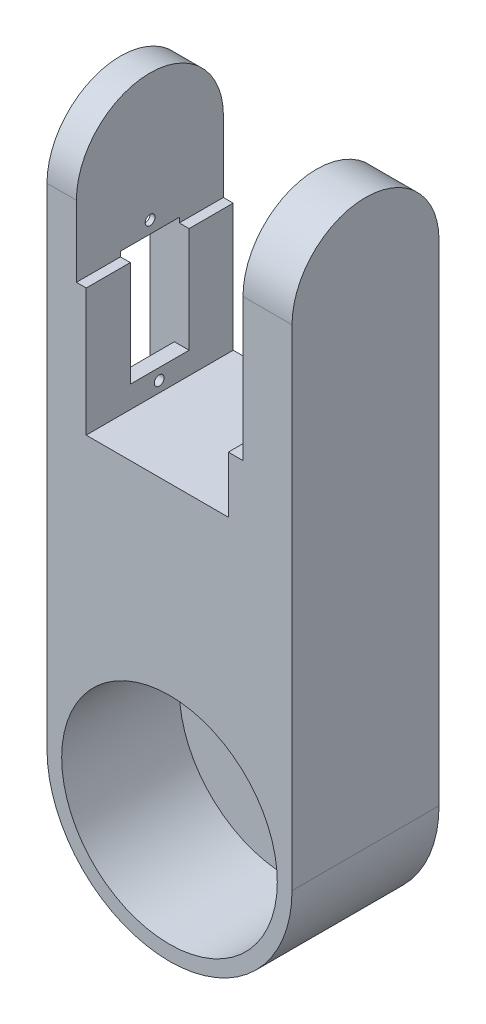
ISO-10303-21;
HEADER;
FILE_DESCRIPTION(('STEP AP214'),'2;1');
FILE_NAME('part.step','',(''),(''),'','','');
FILE_SCHEMA(('AUTOMOTIVE_DESIGN { 1 0 10303 214 1 1 1 1 }'));
ENDSEC;
DATA;
#1=APPLICATION_CONTEXT('core data for automotive mechanical design processes');
#2=APPLICATION_PROTOCOL_DEFINITION('international standard','automotive_design',2000,#1);
#3=PRODUCT_CONTEXT('',#1,'mechanical');
#4=PRODUCT('Part','Part','',(#3));
#5=PRODUCT_RELATED_PRODUCT_CATEGORY('part','',(#4));
#6=PRODUCT_DEFINITION_FORMATION('','',#4);
#7=PRODUCT_DEFINITION_CONTEXT('part definition',#1,'design');
#8=PRODUCT_DEFINITION('design','',#6,#7);
#9=PRODUCT_DEFINITION_SHAPE('','',#8);
#10=(LENGTH_UNIT() NAMED_UNIT(*) SI_UNIT(.MILLI.,.METRE.));
#11=(NAMED_UNIT(*) PLANE_ANGLE_UNIT() SI_UNIT($,.RADIAN.));
#12=(NAMED_UNIT(*) SI_UNIT($,.STERADIAN.) SOLID_ANGLE_UNIT());
#13=UNCERTAINTY_MEASURE_WITH_UNIT(LENGTH_MEASURE(1.E-05),#10,'distance_accuracy_value','');
#14=(GEOMETRIC_REPRESENTATION_CONTEXT(3) GLOBAL_UNCERTAINTY_ASSIGNED_CONTEXT((#13)) GLOBAL_UNIT_ASSIGNED_CONTEXT((#10,
#11,#12)) REPRESENTATION_CONTEXT('',''));
#15=CARTESIAN_POINT('',(0.,0.,0.));
#16=DIRECTION('',(0.,0.,1.));
#17=DIRECTION('',(1.,0.,0.));
#18=AXIS2_PLACEMENT_3D('',#15,#16,#17);
#19=CARTESIAN_POINT('',(15.,70.9790483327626,30.5447277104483));
#20=DIRECTION('',(0.,-1.,0.));
#21=DIRECTION('',(0.,0.,-1.));
#22=AXIS2_PLACEMENT_3D('',#19,#20,#21);
#23=PLANE('',#22);
#24=DIRECTION('',(1.,0.,0.));
#25=VECTOR('',#24,1.);
#26=CARTESIAN_POINT('',(0.,70.9790483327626,30.));
#27=LINE('',#26,#25);
#28=CARTESIAN_POINT('',(12.,70.9790483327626,30.));
#29=VERTEX_POINT('',#28);
#30=CARTESIAN_POINT('',(15.,70.9790483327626,30.));
#31=VERTEX_POINT('',#30);
#32=EDGE_CURVE('E351',#29,#31,#27,.T.);
#33=ORIENTED_EDGE('',*,*,#32,.T.);
#34=DIRECTION('',(0.,0.,-1.));
#35=VECTOR('',#34,1.);
#36=CARTESIAN_POINT('',(15.,70.9790483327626,30.5447277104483));
#37=LINE('',#36,#35);
#38=CARTESIAN_POINT('',(15.,70.9790483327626,0.));
#39=VERTEX_POINT('',#38);
#40=EDGE_CURVE('E10',#31,#39,#37,.T.);
#41=ORIENTED_EDGE('',*,*,#40,.T.);
#42=DIRECTION('',(-1.,0.,0.));
#43=VECTOR('',#42,1.);
#44=CARTESIAN_POINT('',(15.,70.9790483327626,0.));
#45=LINE('',#44,#43);
#46=CARTESIAN_POINT('',(12.,70.9790483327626,0.));
#47=VERTEX_POINT('',#46);
#48=EDGE_CURVE('E406',#39,#47,#45,.T.);
#49=ORIENTED_EDGE('',*,*,#48,.T.);
#50=DIRECTION('',(0.,0.,-1.));
#51=VECTOR('',#50,1.);
#52=CARTESIAN_POINT('',(12.,70.9790483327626,30.5447277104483));
#53=LINE('',#52,#51);
#54=EDGE_CURVE('E384',#29,#47,#53,.T.);
#55=ORIENTED_EDGE('',*,*,#54,.F.);
#56=EDGE_LOOP('',(#33,#41,#49,#55));
#57=FACE_BOUND('',#56,.T.);
#58=ADVANCED_FACE('F16',(#57),#23,.F.);
#59=CARTESIAN_POINT('',(15.,114.979048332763,30.5447277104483));
#60=DIRECTION('',(1.,0.,0.));
#61=DIRECTION('',(0.,1.,0.));
#62=AXIS2_PLACEMENT_3D('',#59,#60,#61);
#63=PLANE('',#62);
#64=DIRECTION('',(0.,1.,0.));
#65=VECTOR('',#64,1.);
#66=CARTESIAN_POINT('',(15.,-0.02095166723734,30.));
#67=LINE('',#66,#65);
#68=CARTESIAN_POINT('',(15.,99.9790483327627,30.));
#69=VERTEX_POINT('',#68);
#70=EDGE_CURVE('E347',#31,#69,#67,.T.);
#71=ORIENTED_EDGE('',*,*,#70,.T.);
#72=CARTESIAN_POINT('',(15.,99.9790483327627,15.));
#73=DIRECTION('',(-1.,0.,0.));
#74=DIRECTION('',(0.,0.,-1.));
#75=AXIS2_PLACEMENT_3D('',#72,#73,#74);
#76=CIRCLE('',#75,15.);
#77=CARTESIAN_POINT('',(15.,99.9790483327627,0.));
#78=VERTEX_POINT('',#77);
#79=EDGE_CURVE('E218',#69,#78,#76,.T.);
#80=ORIENTED_EDGE('',*,*,#79,.T.);
#81=DIRECTION('',(0.,-1.,0.));
#82=VECTOR('',#81,1.);
#83=CARTESIAN_POINT('',(15.,114.979048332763,0.));
#84=LINE('',#83,#82);
#85=EDGE_CURVE('E277',#78,#39,#84,.T.);
#86=ORIENTED_EDGE('',*,*,#85,.T.);
#87=ORIENTED_EDGE('',*,*,#40,.F.);
#88=EDGE_LOOP('',(#71,#80,#86,#87));
#89=FACE_BOUND('',#88,.T.);
#90=ADVANCED_FACE('F490',(#89),#63,.F.);
#91=CARTESIAN_POINT('',(-19.,87.4790483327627,30.5447277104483));
#92=DIRECTION('',(-1.,0.,0.));
#93=DIRECTION('',(0.,0.,1.));
#94=AXIS2_PLACEMENT_3D('',#91,#92,#93);
#95=PLANE('',#94);
#96=CARTESIAN_POINT('',(-19.,88.9790483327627,14.959336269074));
#97=DIRECTION('',(-1.,0.,0.));
#98=DIRECTION('',(0.,-1.,0.));
#99=AXIS2_PLACEMENT_3D('',#96,#97,#98);
#100=CIRCLE('',#99,1.);
#101=CARTESIAN_POINT('',(-19.,87.9790483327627,14.959336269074));
#102=VERTEX_POINT('',#101);
#103=EDGE_CURVE('E251',#102,#102,#100,.T.);
#104=ORIENTED_EDGE('',*,*,#103,.T.);
#105=EDGE_LOOP('',(#104));
#106=FACE_BOUND('',#105,.T.);
#107=DIRECTION('',(0.,-1.,0.));
#108=VECTOR('',#107,1.);
#109=CARTESIAN_POINT('',(-19.,-0.0209516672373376,30.));
#110=LINE('',#109,#108);
#111=CARTESIAN_POINT('',(-19.,99.9790483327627,30.));
#112=VERTEX_POINT('',#111);
#113=CARTESIAN_POINT('',(-19.,85.4790483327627,30.));
#114=VERTEX_POINT('',#113);
#115=EDGE_CURVE('E301',#112,#114,#110,.T.);
#116=ORIENTED_EDGE('',*,*,#115,.T.);
#117=DIRECTION('',(0.,0.,-1.));
#118=VECTOR('',#117,1.);
#119=CARTESIAN_POINT('',(-19.,85.4790483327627,30.5447277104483));
#120=LINE('',#119,#118);
#121=CARTESIAN_POINT('',(-19.,85.4790483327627,21.));
#122=VERTEX_POINT('',#121);
#123=EDGE_CURVE('E259',#114,#122,#120,.T.);
#124=ORIENTED_EDGE('',*,*,#123,.T.);
#125=DIRECTION('',(0.,1.,0.));
#126=VECTOR('',#125,1.);
#127=CARTESIAN_POINT('',(-19.,86.4790483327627,21.));
#128=LINE('',#127,#126);
#129=CARTESIAN_POINT('',(-19.,86.4790483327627,21.));
#130=VERTEX_POINT('',#129);
#131=EDGE_CURVE('E410',#122,#130,#128,.T.);
#132=ORIENTED_EDGE('',*,*,#131,.T.);
#133=DIRECTION('',(0.,0.,-1.));
#134=VECTOR('',#133,1.);
#135=CARTESIAN_POINT('',(-19.,86.4790483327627,9.));
#136=LINE('',#135,#134);
#137=CARTESIAN_POINT('',(-19.,86.4790483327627,9.));
#138=VERTEX_POINT('',#137);
#139=EDGE_CURVE('E227',#130,#138,#136,.T.);
#140=ORIENTED_EDGE('',*,*,#139,.T.);
#141=DIRECTION('',(0.,-1.,0.));
#142=VECTOR('',#141,1.);
#143=CARTESIAN_POINT('',(-19.,63.9790483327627,9.));
#144=LINE('',#143,#142);
#145=CARTESIAN_POINT('',(-19.,85.4790483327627,9.));
#146=VERTEX_POINT('',#145);
#147=EDGE_CURVE('E249',#138,#146,#144,.T.);
#148=ORIENTED_EDGE('',*,*,#147,.T.);
#149=DIRECTION('',(0.,0.,-1.));
#150=VECTOR('',#149,1.);
#151=CARTESIAN_POINT('',(-19.,85.4790483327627,30.5447277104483));
#152=LINE('',#151,#150);
#153=CARTESIAN_POINT('',(-19.,85.4790483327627,0.));
#154=VERTEX_POINT('',#153);
#155=EDGE_CURVE('E27',#146,#154,#152,.T.);
#156=ORIENTED_EDGE('',*,*,#155,.T.);
#157=DIRECTION('',(0.,1.,0.));
#158=VECTOR('',#157,1.);
#159=CARTESIAN_POINT('',(-19.,87.4790483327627,0.));
#160=LINE('',#159,#158);
#161=CARTESIAN_POINT('',(-19.,99.9790483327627,0.));
#162=VERTEX_POINT('',#161);
#163=EDGE_CURVE('E346',#154,#162,#160,.T.);
#164=ORIENTED_EDGE('',*,*,#163,.T.);
#165=CARTESIAN_POINT('',(-19.,99.9790483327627,15.));
#166=DIRECTION('',(1.,0.,0.));
#167=DIRECTION('',(0.,-1.,0.));
#168=AXIS2_PLACEMENT_3D('',#165,#166,#167);
#169=CIRCLE('',#168,15.);
#170=EDGE_CURVE('E402',#162,#112,#169,.T.);
#171=ORIENTED_EDGE('',*,*,#170,.T.);
#172=EDGE_LOOP('',(#116,#124,#132,#140,#148,#156,#164,#171));
#173=FACE_BOUND('',#172,.T.);
#174=ADVANCED_FACE('F496',(#106,#173),#95,.F.);
#175=CARTESIAN_POINT('',(-19.,85.4790483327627,30.5447277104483));
#176=DIRECTION('',(0.,-1.,0.));
#177=DIRECTION('',(0.,0.,-1.));
#178=AXIS2_PLACEMENT_3D('',#175,#176,#177);
#179=PLANE('',#178);
#180=DIRECTION('',(1.,0.,0.));
#181=VECTOR('',#180,1.);
#182=CARTESIAN_POINT('',(-15.5,85.4790483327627,9.));
#183=LINE('',#182,#181);
#184=CARTESIAN_POINT('',(-17.,85.4790483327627,9.));
#185=VERTEX_POINT('',#184);
#186=EDGE_CURVE('E245',#146,#185,#183,.T.);
#187=ORIENTED_EDGE('',*,*,#186,.T.);
#188=DIRECTION('',(0.,0.,-1.));
#189=VECTOR('',#188,1.);
#190=CARTESIAN_POINT('',(-17.,85.4790483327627,30.5447277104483));
#191=LINE('',#190,#189);
#192=CARTESIAN_POINT('',(-17.,85.4790483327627,0.));
#193=VERTEX_POINT('',#192);
#194=EDGE_CURVE('E380',#185,#193,#191,.T.);
#195=ORIENTED_EDGE('',*,*,#194,.T.);
#196=DIRECTION('',(-1.,0.,0.));
#197=VECTOR('',#196,1.);
#198=CARTESIAN_POINT('',(-19.,85.4790483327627,0.));
#199=LINE('',#198,#197);
#200=EDGE_CURVE('E341',#193,#154,#199,.T.);
#201=ORIENTED_EDGE('',*,*,#200,.T.);
#202=ORIENTED_EDGE('',*,*,#155,.F.);
#203=EDGE_LOOP('',(#187,#195,#201,#202));
#204=FACE_BOUND('',#203,.T.);
#205=ADVANCED_FACE('F513',(#204),#179,.F.);
#206=CARTESIAN_POINT('',(-17.,59.4790483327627,30.5447277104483));
#207=DIRECTION('',(0.,-1.,0.));
#208=DIRECTION('',(0.,0.,-1.));
#209=AXIS2_PLACEMENT_3D('',#206,#207,#208);
#210=PLANE('',#209);
#211=DIRECTION('',(1.,0.,0.));
#212=VECTOR('',#211,1.);
#213=CARTESIAN_POINT('',(0.,59.4790483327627,30.));
#214=LINE('',#213,#212);
#215=CARTESIAN_POINT('',(-17.,59.4790483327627,30.));
#216=VERTEX_POINT('',#215);
#217=CARTESIAN_POINT('',(12.,59.4790483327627,30.));
#218=VERTEX_POINT('',#217);
#219=EDGE_CURVE('E264',#216,#218,#214,.T.);
#220=ORIENTED_EDGE('',*,*,#219,.T.);
#221=DIRECTION('',(0.,0.,-1.));
#222=VECTOR('',#221,1.);
#223=CARTESIAN_POINT('',(12.,59.4790483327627,30.5447277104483));
#224=LINE('',#223,#222);
#225=CARTESIAN_POINT('',(12.,59.4790483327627,0.));
#226=VERTEX_POINT('',#225);
#227=EDGE_CURVE('E394',#218,#226,#224,.T.);
#228=ORIENTED_EDGE('',*,*,#227,.T.);
#229=DIRECTION('',(-1.,0.,0.));
#230=VECTOR('',#229,1.);
#231=CARTESIAN_POINT('',(-17.,59.4790483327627,0.));
#232=LINE('',#231,#230);
#233=CARTESIAN_POINT('',(-17.,59.4790483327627,0.));
#234=VERTEX_POINT('',#233);
#235=EDGE_CURVE('E569',#226,#234,#232,.T.);
#236=ORIENTED_EDGE('',*,*,#235,.T.);
#237=DIRECTION('',(0.,0.,-1.));
#238=VECTOR('',#237,1.);
#239=CARTESIAN_POINT('',(-17.,59.4790483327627,30.5447277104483));
#240=LINE('',#239,#238);
#241=EDGE_CURVE('E379',#216,#234,#240,.T.);
#242=ORIENTED_EDGE('',*,*,#241,.F.);
#243=EDGE_LOOP('',(#220,#228,#236,#242));
#244=FACE_BOUND('',#243,.T.);
#245=ADVANCED_FACE('F509',(#244),#210,.F.);
#246=CARTESIAN_POINT('',(12.,70.9790483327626,30.5447277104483));
#247=DIRECTION('',(1.,0.,0.));
#248=DIRECTION('',(0.,1.,0.));
#249=AXIS2_PLACEMENT_3D('',#246,#247,#248);
#250=PLANE('',#249);
#251=DIRECTION('',(0.,1.,0.));
#252=VECTOR('',#251,1.);
#253=CARTESIAN_POINT('',(12.,-0.0209516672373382,30.));
#254=LINE('',#253,#252);
#255=EDGE_CURVE('E269',#218,#29,#254,.T.);
#256=ORIENTED_EDGE('',*,*,#255,.T.);
#257=ORIENTED_EDGE('',*,*,#54,.T.);
#258=DIRECTION('',(0.,-1.,0.));
#259=VECTOR('',#258,1.);
#260=CARTESIAN_POINT('',(12.,70.9790483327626,0.));
#261=LINE('',#260,#259);
#262=EDGE_CURVE('E419',#47,#226,#261,.T.);
#263=ORIENTED_EDGE('',*,*,#262,.T.);
#264=ORIENTED_EDGE('',*,*,#227,.F.);
#265=EDGE_LOOP('',(#256,#257,#263,#264));
#266=FACE_BOUND('',#265,.T.);
#267=ADVANCED_FACE('F512',(#266),#250,.F.);
#268=CARTESIAN_POINT('',(-17.,85.4790483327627,30.5447277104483));
#269=DIRECTION('',(-1.,0.,0.));
#270=DIRECTION('',(0.,0.,1.));
#271=AXIS2_PLACEMENT_3D('',#268,#269,#270);
#272=PLANE('',#271);
#273=CARTESIAN_POINT('',(-17.,61.6790483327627,15.1));
#274=DIRECTION('',(1.,0.,0.));
#275=DIRECTION('',(0.,0.,1.));
#276=AXIS2_PLACEMENT_3D('',#273,#274,#275);
#277=CIRCLE('',#276,1.);
#278=CARTESIAN_POINT('',(-17.,61.6790483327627,16.1));
#279=VERTEX_POINT('',#278);
#280=EDGE_CURVE('E39',#279,#279,#277,.T.);
#281=ORIENTED_EDGE('',*,*,#280,.F.);
#282=EDGE_LOOP('',(#281));
#283=FACE_BOUND('',#282,.T.);
#284=DIRECTION('',(0.,-1.,0.));
#285=VECTOR('',#284,1.);
#286=CARTESIAN_POINT('',(-17.,-0.02095166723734,30.));
#287=LINE('',#286,#285);
#288=CARTESIAN_POINT('',(-17.,85.4790483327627,30.));
#289=VERTEX_POINT('',#288);
#290=EDGE_CURVE('E268',#289,#216,#287,.T.);
#291=ORIENTED_EDGE('',*,*,#290,.T.);
#292=ORIENTED_EDGE('',*,*,#241,.T.);
#293=DIRECTION('',(0.,1.,0.));
#294=VECTOR('',#293,1.);
#295=CARTESIAN_POINT('',(-17.,85.4790483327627,0.));
#296=LINE('',#295,#294);
#297=EDGE_CURVE('E345',#234,#193,#296,.T.);
#298=ORIENTED_EDGE('',*,*,#297,.T.);
#299=ORIENTED_EDGE('',*,*,#194,.F.);
#300=DIRECTION('',(0.,-1.,0.));
#301=VECTOR('',#300,1.);
#302=CARTESIAN_POINT('',(-17.,63.9790483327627,9.));
#303=LINE('',#302,#301);
#304=CARTESIAN_POINT('',(-17.,63.9790483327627,9.));
#305=VERTEX_POINT('',#304);
#306=EDGE_CURVE('E250',#185,#305,#303,.T.);
#307=ORIENTED_EDGE('',*,*,#306,.T.);
#308=DIRECTION('',(0.,0.,1.));
#309=VECTOR('',#308,1.);
#310=CARTESIAN_POINT('',(-17.,63.9790483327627,21.));
#311=LINE('',#310,#309);
#312=CARTESIAN_POINT('',(-17.,63.9790483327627,21.));
#313=VERTEX_POINT('',#312);
#314=EDGE_CURVE('E320',#305,#313,#311,.T.);
#315=ORIENTED_EDGE('',*,*,#314,.T.);
#316=DIRECTION('',(0.,1.,0.));
#317=VECTOR('',#316,1.);
#318=CARTESIAN_POINT('',(-17.,86.4790483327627,21.));
#319=LINE('',#318,#317);
#320=CARTESIAN_POINT('',(-17.,85.4790483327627,21.));
#321=VERTEX_POINT('',#320);
#322=EDGE_CURVE('E306',#313,#321,#319,.T.);
#323=ORIENTED_EDGE('',*,*,#322,.T.);
#324=DIRECTION('',(0.,0.,-1.));
#325=VECTOR('',#324,1.);
#326=CARTESIAN_POINT('',(-17.,85.4790483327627,30.5447277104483));
#327=LINE('',#326,#325);
#328=EDGE_CURVE('E255',#289,#321,#327,.T.);
#329=ORIENTED_EDGE('',*,*,#328,.F.);
#330=EDGE_LOOP('',(#291,#292,#298,#299,#307,#315,#323,#329));
#331=FACE_BOUND('',#330,.T.);
#332=ADVANCED_FACE('F647',(#283,#331),#272,.F.);
#333=CARTESIAN_POINT('',(-19.,85.4790483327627,30.5447277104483));
#334=DIRECTION('',(0.,-1.,0.));
#335=DIRECTION('',(0.,0.,-1.));
#336=AXIS2_PLACEMENT_3D('',#333,#334,#335);
#337=PLANE('',#336);
#338=DIRECTION('',(1.,0.,0.));
#339=VECTOR('',#338,1.);
#340=CARTESIAN_POINT('',(0.,85.4790483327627,30.));
#341=LINE('',#340,#339);
#342=EDGE_CURVE('E311',#114,#289,#341,.T.);
#343=ORIENTED_EDGE('',*,*,#342,.T.);
#344=ORIENTED_EDGE('',*,*,#328,.T.);
#345=DIRECTION('',(-1.,0.,0.));
#346=VECTOR('',#345,1.);
#347=CARTESIAN_POINT('',(-15.5,85.4790483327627,21.));
#348=LINE('',#347,#346);
#349=EDGE_CURVE('E440',#321,#122,#348,.T.);
#350=ORIENTED_EDGE('',*,*,#349,.T.);
#351=ORIENTED_EDGE('',*,*,#123,.F.);
#352=EDGE_LOOP('',(#343,#344,#350,#351));
#353=FACE_BOUND('',#352,.T.);
#354=ADVANCED_FACE('F651',(#353),#337,.F.);
#355=CARTESIAN_POINT('',(-17.,61.6790483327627,15.1));
#356=DIRECTION('',(-1.,0.,0.));
#357=DIRECTION('',(0.,0.,1.));
#358=AXIS2_PLACEMENT_3D('',#355,#356,#357);
#359=CYLINDRICAL_SURFACE('',#358,1.);
#360=CARTESIAN_POINT('',(-20.,61.6790483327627,15.1));
#361=DIRECTION('',(1.,0.,0.));
#362=DIRECTION('',(0.,0.,-1.));
#363=AXIS2_PLACEMENT_3D('',#360,#361,#362);
#364=CIRCLE('',#363,1.);
#365=CARTESIAN_POINT('',(-20.,61.6790483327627,14.1));
#366=VERTEX_POINT('',#365);
#367=EDGE_CURVE('E254',#366,#366,#364,.T.);
#368=ORIENTED_EDGE('',*,*,#367,.F.);
#369=EDGE_LOOP('',(#368));
#370=FACE_BOUND('',#369,.T.);
#371=ORIENTED_EDGE('',*,*,#280,.T.);
#372=EDGE_LOOP('',(#371));
#373=FACE_BOUND('',#372,.T.);
#374=ADVANCED_FACE('F501',(#370,#373),#359,.F.);
#375=CARTESIAN_POINT('',(-17.,88.9790483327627,14.959336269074));
#376=DIRECTION('',(-1.,0.,0.));
#377=DIRECTION('',(0.,0.,1.));
#378=AXIS2_PLACEMENT_3D('',#375,#376,#377);
#379=CYLINDRICAL_SURFACE('',#378,1.);
#380=CARTESIAN_POINT('',(-20.,88.9790483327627,14.959336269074));
#381=DIRECTION('',(1.,0.,0.));
#382=DIRECTION('',(0.,0.,1.));
#383=AXIS2_PLACEMENT_3D('',#380,#381,#382);
#384=CIRCLE('',#383,1.);
#385=CARTESIAN_POINT('',(-20.,88.9790483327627,15.959336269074));
#386=VERTEX_POINT('',#385);
#387=EDGE_CURVE('E240',#386,#386,#384,.T.);
#388=ORIENTED_EDGE('',*,*,#387,.F.);
#389=EDGE_LOOP('',(#388));
#390=FACE_BOUND('',#389,.T.);
#391=ORIENTED_EDGE('',*,*,#103,.F.);
#392=EDGE_LOOP('',(#391));
#393=FACE_BOUND('',#392,.T.);
#394=ADVANCED_FACE('F665',(#390,#393),#379,.F.);
#395=CARTESIAN_POINT('',(-20.,0.,0.));
#396=DIRECTION('',(1.,0.,0.));
#397=DIRECTION('',(0.,1.,0.));
#398=AXIS2_PLACEMENT_3D('',#395,#396,#397);
#399=PLANE('',#398);
#400=DIRECTION('',(0.,0.,-1.));
#401=VECTOR('',#400,1.);
#402=CARTESIAN_POINT('',(-20.,58.4790483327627,21.));
#403=LINE('',#402,#401);
#404=CARTESIAN_POINT('',(-20.,58.4790483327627,21.));
#405=VERTEX_POINT('',#404);
#406=CARTESIAN_POINT('',(-20.,58.4790483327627,9.));
#407=VERTEX_POINT('',#406);
#408=EDGE_CURVE('E243',#405,#407,#403,.T.);
#409=ORIENTED_EDGE('',*,*,#408,.F.);
#410=DIRECTION('',(0.,-1.,0.));
#411=VECTOR('',#410,1.);
#412=CARTESIAN_POINT('',(-20.,59.4790483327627,21.));
#413=LINE('',#412,#411);
#414=CARTESIAN_POINT('',(-20.,63.9790483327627,21.));
#415=VERTEX_POINT('',#414);
#416=EDGE_CURVE('E364',#415,#405,#413,.T.);
#417=ORIENTED_EDGE('',*,*,#416,.F.);
#418=DIRECTION('',(0.,0.,1.));
#419=VECTOR('',#418,1.);
#420=CARTESIAN_POINT('',(-20.,63.9790483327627,21.));
#421=LINE('',#420,#419);
#422=CARTESIAN_POINT('',(-20.,63.9790483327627,9.));
#423=VERTEX_POINT('',#422);
#424=EDGE_CURVE('E278',#423,#415,#421,.T.);
#425=ORIENTED_EDGE('',*,*,#424,.F.);
#426=DIRECTION('',(0.,1.,0.));
#427=VECTOR('',#426,1.);
#428=CARTESIAN_POINT('',(-20.,59.4790483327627,9.));
#429=LINE('',#428,#427);
#430=EDGE_CURVE('E262',#407,#423,#429,.T.);
#431=ORIENTED_EDGE('',*,*,#430,.F.);
#432=EDGE_LOOP('',(#409,#417,#425,#431));
#433=FACE_BOUND('',#432,.T.);
#434=ORIENTED_EDGE('',*,*,#367,.T.);
#435=EDGE_LOOP('',(#434));
#436=FACE_BOUND('',#435,.T.);
#437=ADVANCED_FACE('F662',(#433,#436),#399,.F.);
#438=CARTESIAN_POINT('',(-20.,58.4790483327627,21.));
#439=DIRECTION('',(0.,1.,0.));
#440=DIRECTION('',(1.,0.,0.));
#441=AXIS2_PLACEMENT_3D('',#438,#439,#440);
#442=PLANE('',#441);
#443=DIRECTION('',(0.,0.,-1.));
#444=VECTOR('',#443,1.);
#445=CARTESIAN_POINT('',(-25.,58.4790483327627,21.));
#446=LINE('',#445,#444);
#447=CARTESIAN_POINT('',(-25.,58.4790483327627,21.));
#448=VERTEX_POINT('',#447);
#449=CARTESIAN_POINT('',(-25.,58.4790483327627,9.));
#450=VERTEX_POINT('',#449);
#451=EDGE_CURVE('E238',#448,#450,#446,.T.);
#452=ORIENTED_EDGE('',*,*,#451,.F.);
#453=DIRECTION('',(-1.,0.,0.));
#454=VECTOR('',#453,1.);
#455=CARTESIAN_POINT('',(-20.,58.4790483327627,21.));
#456=LINE('',#455,#454);
#457=EDGE_CURVE('E337',#405,#448,#456,.T.);
#458=ORIENTED_EDGE('',*,*,#457,.F.);
#459=ORIENTED_EDGE('',*,*,#408,.T.);
#460=DIRECTION('',(-1.,0.,0.));
#461=VECTOR('',#460,1.);
#462=CARTESIAN_POINT('',(-20.,58.4790483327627,9.));
#463=LINE('',#462,#461);
#464=EDGE_CURVE('E295',#407,#450,#463,.T.);
#465=ORIENTED_EDGE('',*,*,#464,.T.);
#466=EDGE_LOOP('',(#452,#458,#459,#465));
#467=FACE_BOUND('',#466,.T.);
#468=ADVANCED_FACE('F589',(#467),#442,.T.);
#469=CARTESIAN_POINT('',(-20.,0.,0.));
#470=DIRECTION('',(-1.,0.,0.));
#471=DIRECTION('',(0.,0.,1.));
#472=AXIS2_PLACEMENT_3D('',#469,#470,#471);
#473=PLANE('',#472);
#474=DIRECTION('',(0.,-1.,0.));
#475=VECTOR('',#474,1.);
#476=CARTESIAN_POINT('',(-20.,90.9790483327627,9.));
#477=LINE('',#476,#475);
#478=CARTESIAN_POINT('',(-20.,91.9790483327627,9.));
#479=VERTEX_POINT('',#478);
#480=CARTESIAN_POINT('',(-20.,86.4790483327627,9.));
#481=VERTEX_POINT('',#480);
#482=EDGE_CURVE('E312',#479,#481,#477,.T.);
#483=ORIENTED_EDGE('',*,*,#482,.T.);
#484=DIRECTION('',(0.,0.,1.));
#485=VECTOR('',#484,1.);
#486=CARTESIAN_POINT('',(-20.,86.4790483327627,21.));
#487=LINE('',#486,#485);
#488=CARTESIAN_POINT('',(-20.,86.4790483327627,21.));
#489=VERTEX_POINT('',#488);
#490=EDGE_CURVE('E307',#481,#489,#487,.T.);
#491=ORIENTED_EDGE('',*,*,#490,.T.);
#492=DIRECTION('',(0.,1.,0.));
#493=VECTOR('',#492,1.);
#494=CARTESIAN_POINT('',(-20.,90.9790483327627,21.));
#495=LINE('',#494,#493);
#496=CARTESIAN_POINT('',(-20.,91.9790483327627,21.));
#497=VERTEX_POINT('',#496);
#498=EDGE_CURVE('E336',#489,#497,#495,.T.);
#499=ORIENTED_EDGE('',*,*,#498,.T.);
#500=DIRECTION('',(0.,0.,-1.));
#501=VECTOR('',#500,1.);
#502=CARTESIAN_POINT('',(-20.,91.9790483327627,21.));
#503=LINE('',#502,#501);
#504=EDGE_CURVE('E244',#497,#479,#503,.T.);
#505=ORIENTED_EDGE('',*,*,#504,.T.);
#506=EDGE_LOOP('',(#483,#491,#499,#505));
#507=FACE_BOUND('',#506,.T.);
#508=ORIENTED_EDGE('',*,*,#387,.T.);
#509=EDGE_LOOP('',(#508));
#510=FACE_BOUND('',#509,.T.);
#511=ADVANCED_FACE('F525',(#507,#510),#473,.T.);
#512=CARTESIAN_POINT('',(-20.,91.9790483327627,21.));
#513=DIRECTION('',(0.,1.,0.));
#514=DIRECTION('',(1.,0.,0.));
#515=AXIS2_PLACEMENT_3D('',#512,#513,#514);
#516=PLANE('',#515);
#517=DIRECTION('',(0.,0.,-1.));
#518=VECTOR('',#517,1.);
#519=CARTESIAN_POINT('',(-25.,91.9790483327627,21.));
#520=LINE('',#519,#518);
#521=CARTESIAN_POINT('',(-25.,91.9790483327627,21.));
#522=VERTEX_POINT('',#521);
#523=CARTESIAN_POINT('',(-25.,91.9790483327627,9.));
#524=VERTEX_POINT('',#523);
#525=EDGE_CURVE('E434',#522,#524,#520,.T.);
#526=ORIENTED_EDGE('',*,*,#525,.T.);
#527=DIRECTION('',(-1.,0.,0.));
#528=VECTOR('',#527,1.);
#529=CARTESIAN_POINT('',(-20.,91.9790483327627,9.));
#530=LINE('',#529,#528);
#531=EDGE_CURVE('E315',#479,#524,#530,.T.);
#532=ORIENTED_EDGE('',*,*,#531,.F.);
#533=ORIENTED_EDGE('',*,*,#504,.F.);
#534=DIRECTION('',(-1.,0.,0.));
#535=VECTOR('',#534,1.);
#536=CARTESIAN_POINT('',(-20.,91.9790483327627,21.));
#537=LINE('',#536,#535);
#538=EDGE_CURVE('E332',#497,#522,#537,.T.);
#539=ORIENTED_EDGE('',*,*,#538,.T.);
#540=EDGE_LOOP('',(#526,#532,#533,#539));
#541=FACE_BOUND('',#540,.T.);
#542=ADVANCED_FACE('F522',(#541),#516,.F.);
#543=CARTESIAN_POINT('',(-15.5,63.9790483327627,9.));
#544=DIRECTION('',(0.,0.,1.));
#545=DIRECTION('',(0.,-1.,0.));
#546=AXIS2_PLACEMENT_3D('',#543,#544,#545);
#547=PLANE('',#546);
#548=ORIENTED_EDGE('',*,*,#306,.F.);
#549=ORIENTED_EDGE('',*,*,#186,.F.);
#550=ORIENTED_EDGE('',*,*,#147,.F.);
#551=DIRECTION('',(-1.,0.,0.));
#552=VECTOR('',#551,1.);
#553=CARTESIAN_POINT('',(-15.5,86.4790483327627,9.));
#554=LINE('',#553,#552);
#555=EDGE_CURVE('E302',#138,#481,#554,.T.);
#556=ORIENTED_EDGE('',*,*,#555,.T.);
#557=ORIENTED_EDGE('',*,*,#482,.F.);
#558=ORIENTED_EDGE('',*,*,#531,.T.);
#559=DIRECTION('',(0.,1.,0.));
#560=VECTOR('',#559,1.);
#561=CARTESIAN_POINT('',(-25.,63.9790483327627,9.));
#562=LINE('',#561,#560);
#563=EDGE_CURVE('E430',#450,#524,#562,.T.);
#564=ORIENTED_EDGE('',*,*,#563,.F.);
#565=ORIENTED_EDGE('',*,*,#464,.F.);
#566=ORIENTED_EDGE('',*,*,#430,.T.);
#567=DIRECTION('',(-1.,0.,0.));
#568=VECTOR('',#567,1.);
#569=CARTESIAN_POINT('',(-15.5,63.9790483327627,9.));
#570=LINE('',#569,#568);
#571=EDGE_CURVE('E283',#305,#423,#570,.T.);
#572=ORIENTED_EDGE('',*,*,#571,.F.);
#573=EDGE_LOOP('',(#548,#549,#550,#556,#557,#558,#564,#565,#566,#572));
#574=FACE_BOUND('',#573,.T.);
#575=ADVANCED_FACE('F524',(#574),#547,.T.);
#576=CARTESIAN_POINT('',(-15.5,86.4790483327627,21.));
#577=DIRECTION('',(0.,0.,-1.));
#578=DIRECTION('',(0.,-1.,0.));
#579=AXIS2_PLACEMENT_3D('',#576,#577,#578);
#580=PLANE('',#579);
#581=ORIENTED_EDGE('',*,*,#322,.F.);
#582=DIRECTION('',(-1.,0.,0.));
#583=VECTOR('',#582,1.);
#584=CARTESIAN_POINT('',(-15.5,63.9790483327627,21.));
#585=LINE('',#584,#583);
#586=EDGE_CURVE('E282',#313,#415,#585,.T.);
#587=ORIENTED_EDGE('',*,*,#586,.T.);
#588=ORIENTED_EDGE('',*,*,#416,.T.);
#589=ORIENTED_EDGE('',*,*,#457,.T.);
#590=DIRECTION('',(0.,-1.,0.));
#591=VECTOR('',#590,1.);
#592=CARTESIAN_POINT('',(-25.,86.4790483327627,21.));
#593=LINE('',#592,#591);
#594=EDGE_CURVE('E554',#522,#448,#593,.T.);
#595=ORIENTED_EDGE('',*,*,#594,.F.);
#596=ORIENTED_EDGE('',*,*,#538,.F.);
#597=ORIENTED_EDGE('',*,*,#498,.F.);
#598=DIRECTION('',(-1.,0.,0.));
#599=VECTOR('',#598,1.);
#600=CARTESIAN_POINT('',(-15.5,86.4790483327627,21.));
#601=LINE('',#600,#599);
#602=EDGE_CURVE('E331',#130,#489,#601,.T.);
#603=ORIENTED_EDGE('',*,*,#602,.F.);
#604=ORIENTED_EDGE('',*,*,#131,.F.);
#605=ORIENTED_EDGE('',*,*,#349,.F.);
#606=EDGE_LOOP('',(#581,#587,#588,#589,#595,#596,#597,#603,#604,#605));
#607=FACE_BOUND('',#606,.T.);
#608=ADVANCED_FACE('F644',(#607),#580,.T.);
#609=CARTESIAN_POINT('',(-15.5,86.4790483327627,9.));
#610=DIRECTION('',(0.,-1.,0.));
#611=DIRECTION('',(0.,0.,-1.));
#612=AXIS2_PLACEMENT_3D('',#609,#610,#611);
#613=PLANE('',#612);
#614=ORIENTED_EDGE('',*,*,#139,.F.);
#615=ORIENTED_EDGE('',*,*,#602,.T.);
#616=ORIENTED_EDGE('',*,*,#490,.F.);
#617=ORIENTED_EDGE('',*,*,#555,.F.);
#618=EDGE_LOOP('',(#614,#615,#616,#617));
#619=FACE_BOUND('',#618,.T.);
#620=ADVANCED_FACE('F680',(#619),#613,.T.);
#621=CARTESIAN_POINT('',(25.,99.9790483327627,15.));
#622=DIRECTION('',(-1.,0.,0.));
#623=DIRECTION('',(0.,0.,1.));
#624=AXIS2_PLACEMENT_3D('',#621,#622,#623);
#625=CYLINDRICAL_SURFACE('',#624,15.);
#626=ORIENTED_EDGE('',*,*,#79,.F.);
#627=DIRECTION('',(-1.,0.,0.));
#628=VECTOR('',#627,1.);
#629=CARTESIAN_POINT('',(0.,99.9790483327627,30.));
#630=LINE('',#629,#628);
#631=CARTESIAN_POINT('',(25.,99.9790483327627,30.0000001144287));
#632=VERTEX_POINT('',#631);
#633=EDGE_CURVE('E352',#632,#69,#630,.T.);
#634=ORIENTED_EDGE('',*,*,#633,.F.);
#635=CARTESIAN_POINT('',(25.,99.9790483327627,15.));
#636=DIRECTION('',(-1.,0.,0.));
#637=DIRECTION('',(0.,0.,1.));
#638=AXIS2_PLACEMENT_3D('',#635,#636,#637);
#639=CIRCLE('',#638,15.);
#640=CARTESIAN_POINT('',(25.,99.9790483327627,-1.14428739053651E-07));
#641=VERTEX_POINT('',#640);
#642=EDGE_CURVE('E60',#632,#641,#639,.T.);
#643=ORIENTED_EDGE('',*,*,#642,.T.);
#644=DIRECTION('',(1.,0.,0.));
#645=VECTOR('',#644,1.);
#646=CARTESIAN_POINT('',(-25.,99.9790483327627,0.));
#647=LINE('',#646,#645);
#648=EDGE_CURVE('E388',#78,#641,#647,.T.);
#649=ORIENTED_EDGE('',*,*,#648,.F.);
#650=EDGE_LOOP('',(#626,#634,#643,#649));
#651=FACE_BOUND('',#650,.T.);
#652=ADVANCED_FACE('F483',(#651),#625,.T.);
#653=CARTESIAN_POINT('',(0.,0.,6.));
#654=DIRECTION('',(0.,0.,1.));
#655=DIRECTION('',(1.,0.,0.));
#656=AXIS2_PLACEMENT_3D('',#653,#654,#655);
#657=CYLINDRICAL_SURFACE('',#656,22.);
#658=CARTESIAN_POINT('',(0.,0.,30.));
#659=DIRECTION('',(0.,0.,-1.));
#660=DIRECTION('',(0.,1.,0.));
#661=AXIS2_PLACEMENT_3D('',#658,#659,#660);
#662=CIRCLE('',#661,22.);
#663=CARTESIAN_POINT('',(0.,22.,30.));
#664=VERTEX_POINT('',#663);
#665=EDGE_CURVE('E308',#664,#664,#662,.T.);
#666=ORIENTED_EDGE('',*,*,#665,.F.);
#667=EDGE_LOOP('',(#666));
#668=FACE_BOUND('',#667,.T.);
#669=CARTESIAN_POINT('',(0.,0.,6.));
#670=DIRECTION('',(0.,0.,-1.));
#671=DIRECTION('',(0.,1.,0.));
#672=AXIS2_PLACEMENT_3D('',#669,#670,#671);
#673=CIRCLE('',#672,22.);
#674=CARTESIAN_POINT('',(0.,22.,6.));
#675=VERTEX_POINT('',#674);
#676=EDGE_CURVE('E214',#675,#675,#673,.T.);
#677=ORIENTED_EDGE('',*,*,#676,.T.);
#678=EDGE_LOOP('',(#677));
#679=FACE_BOUND('',#678,.T.);
#680=ADVANCED_FACE('F215',(#668,#679),#657,.F.);
#681=CARTESIAN_POINT('',(0.,0.,6.));
#682=DIRECTION('',(0.,0.,-1.));
#683=DIRECTION('',(0.,-1.,0.));
#684=AXIS2_PLACEMENT_3D('',#681,#682,#683);
#685=PLANE('',#684);
#686=CARTESIAN_POINT('',(-7.2,-0.136207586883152,6.));
#687=DIRECTION('',(0.,0.,1.));
#688=DIRECTION('',(-1.,0.,0.));
#689=AXIS2_PLACEMENT_3D('',#686,#687,#688);
#690=CIRCLE('',#689,1.5);
#691=CARTESIAN_POINT('',(-8.7,-0.136207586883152,6.));
#692=VERTEX_POINT('',#691);
#693=EDGE_CURVE('E287',#692,#692,#690,.T.);
#694=ORIENTED_EDGE('',*,*,#693,.F.);
#695=EDGE_LOOP('',(#694));
#696=FACE_BOUND('',#695,.T.);
#697=ORIENTED_EDGE('',*,*,#676,.F.);
#698=EDGE_LOOP('',(#697));
#699=FACE_BOUND('',#698,.T.);
#700=CARTESIAN_POINT('',(7.2,-0.136207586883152,6.));
#701=DIRECTION('',(0.,0.,-1.));
#702=DIRECTION('',(-1.,0.,0.));
#703=AXIS2_PLACEMENT_3D('',#700,#701,#702);
#704=CIRCLE('',#703,1.5);
#705=CARTESIAN_POINT('',(5.7,-0.136207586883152,6.));
#706=VERTEX_POINT('',#705);
#707=EDGE_CURVE('E327',#706,#706,#704,.T.);
#708=ORIENTED_EDGE('',*,*,#707,.T.);
#709=EDGE_LOOP('',(#708));
#710=FACE_BOUND('',#709,.T.);
#711=CARTESIAN_POINT('',(0.,-0.0950429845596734,6.));
#712=DIRECTION('',(0.,0.,-1.));
#713=DIRECTION('',(-1.,0.,0.));
#714=AXIS2_PLACEMENT_3D('',#711,#712,#713);
#715=CIRCLE('',#714,3.75);
#716=CARTESIAN_POINT('',(-3.75,-0.0950429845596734,6.));
#717=VERTEX_POINT('',#716);
#718=EDGE_CURVE('E272',#717,#717,#715,.T.);
#719=ORIENTED_EDGE('',*,*,#718,.T.);
#720=EDGE_LOOP('',(#719));
#721=FACE_BOUND('',#720,.T.);
#722=ADVANCED_FACE('F471',(#696,#699,#710,#721),#685,.F.);
#723=CARTESIAN_POINT('',(0.,0.,5.));
#724=DIRECTION('',(0.,0.,-1.));
#725=DIRECTION('',(-1.,0.,0.));
#726=AXIS2_PLACEMENT_3D('',#723,#724,#725);
#727=CYLINDRICAL_SURFACE('',#726,12.5);
#728=CARTESIAN_POINT('',(0.,0.,0.));
#729=DIRECTION('',(0.,0.,1.));
#730=DIRECTION('',(0.,1.,0.));
#731=AXIS2_PLACEMENT_3D('',#728,#729,#730);
#732=CIRCLE('',#731,12.5);
#733=CARTESIAN_POINT('',(0.,12.5,0.));
#734=VERTEX_POINT('',#733);
#735=EDGE_CURVE('E273',#734,#734,#732,.T.);
#736=ORIENTED_EDGE('',*,*,#735,.F.);
#737=EDGE_LOOP('',(#736));
#738=FACE_BOUND('',#737,.T.);
#739=CARTESIAN_POINT('',(0.,0.,5.));
#740=DIRECTION('',(0.,0.,1.));
#741=DIRECTION('',(0.,1.,0.));
#742=AXIS2_PLACEMENT_3D('',#739,#740,#741);
#743=CIRCLE('',#742,12.5);
#744=CARTESIAN_POINT('',(0.,12.5,5.));
#745=VERTEX_POINT('',#744);
#746=EDGE_CURVE('E219',#745,#745,#743,.T.);
#747=ORIENTED_EDGE('',*,*,#746,.T.);
#748=EDGE_LOOP('',(#747));
#749=FACE_BOUND('',#748,.T.);
#750=ADVANCED_FACE('F473',(#738,#749),#727,.F.);
#751=CARTESIAN_POINT('',(0.,0.,5.));
#752=DIRECTION('',(0.,0.,1.));
#753=DIRECTION('',(1.,0.,0.));
#754=AXIS2_PLACEMENT_3D('',#751,#752,#753);
#755=PLANE('',#754);
#756=CARTESIAN_POINT('',(-7.2,-0.136207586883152,5.));
#757=DIRECTION('',(0.,0.,-1.));
#758=DIRECTION('',(1.,0.,0.));
#759=AXIS2_PLACEMENT_3D('',#756,#757,#758);
#760=CIRCLE('',#759,1.5);
#761=CARTESIAN_POINT('',(-5.7,-0.136207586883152,5.));
#762=VERTEX_POINT('',#761);
#763=EDGE_CURVE('E229',#762,#762,#760,.T.);
#764=ORIENTED_EDGE('',*,*,#763,.F.);
#765=EDGE_LOOP('',(#764));
#766=FACE_BOUND('',#765,.T.);
#767=ORIENTED_EDGE('',*,*,#746,.F.);
#768=EDGE_LOOP('',(#767));
#769=FACE_BOUND('',#768,.T.);
#770=CARTESIAN_POINT('',(7.2,-0.136207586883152,5.));
#771=DIRECTION('',(0.,0.,1.));
#772=DIRECTION('',(1.,0.,0.));
#773=AXIS2_PLACEMENT_3D('',#770,#771,#772);
#774=CIRCLE('',#773,1.5);
#775=CARTESIAN_POINT('',(8.7,-0.136207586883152,5.));
#776=VERTEX_POINT('',#775);
#777=EDGE_CURVE('E291',#776,#776,#774,.T.);
#778=ORIENTED_EDGE('',*,*,#777,.T.);
#779=EDGE_LOOP('',(#778));
#780=FACE_BOUND('',#779,.T.);
#781=CARTESIAN_POINT('',(0.,-0.0950429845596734,5.));
#782=DIRECTION('',(0.,0.,1.));
#783=DIRECTION('',(1.,0.,0.));
#784=AXIS2_PLACEMENT_3D('',#781,#782,#783);
#785=CIRCLE('',#784,3.75);
#786=CARTESIAN_POINT('',(3.75,-0.0950429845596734,5.));
#787=VERTEX_POINT('',#786);
#788=EDGE_CURVE('E340',#787,#787,#785,.T.);
#789=ORIENTED_EDGE('',*,*,#788,.T.);
#790=EDGE_LOOP('',(#789));
#791=FACE_BOUND('',#790,.T.);
#792=ADVANCED_FACE('F459',(#766,#769,#780,#791),#755,.F.);
#793=CARTESIAN_POINT('',(-7.2,-0.136207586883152,30.));
#794=DIRECTION('',(0.,0.,-1.));
#795=DIRECTION('',(-1.,0.,0.));
#796=AXIS2_PLACEMENT_3D('',#793,#794,#795);
#797=CYLINDRICAL_SURFACE('',#796,1.5);
#798=ORIENTED_EDGE('',*,*,#763,.T.);
#799=EDGE_LOOP('',(#798));
#800=FACE_BOUND('',#799,.T.);
#801=ORIENTED_EDGE('',*,*,#693,.T.);
#802=EDGE_LOOP('',(#801));
#803=FACE_BOUND('',#802,.T.);
#804=ADVANCED_FACE('F676',(#800,#803),#797,.F.);
#805=CARTESIAN_POINT('',(7.2,-0.136207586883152,30.));
#806=DIRECTION('',(0.,0.,-1.));
#807=DIRECTION('',(-1.,0.,0.));
#808=AXIS2_PLACEMENT_3D('',#805,#806,#807);
#809=CYLINDRICAL_SURFACE('',#808,1.5);
#810=ORIENTED_EDGE('',*,*,#777,.F.);
#811=EDGE_LOOP('',(#810));
#812=FACE_BOUND('',#811,.T.);
#813=ORIENTED_EDGE('',*,*,#707,.F.);
#814=EDGE_LOOP('',(#813));
#815=FACE_BOUND('',#814,.T.);
#816=ADVANCED_FACE('F467',(#812,#815),#809,.F.);
#817=CARTESIAN_POINT('',(0.,-0.0950429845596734,30.));
#818=DIRECTION('',(0.,0.,-1.));
#819=DIRECTION('',(-1.,0.,0.));
#820=AXIS2_PLACEMENT_3D('',#817,#818,#819);
#821=CYLINDRICAL_SURFACE('',#820,3.75);
#822=ORIENTED_EDGE('',*,*,#788,.F.);
#823=EDGE_LOOP('',(#822));
#824=FACE_BOUND('',#823,.T.);
#825=ORIENTED_EDGE('',*,*,#718,.F.);
#826=EDGE_LOOP('',(#825));
#827=FACE_BOUND('',#826,.T.);
#828=ADVANCED_FACE('F463',(#824,#827),#821,.F.);
#829=CARTESIAN_POINT('',(25.,99.9790483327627,30.));
#830=DIRECTION('',(-1.,0.,0.));
#831=DIRECTION('',(0.,0.,1.));
#832=AXIS2_PLACEMENT_3D('',#829,#830,#831);
#833=PLANE('',#832);
#834=DIRECTION('',(0.,1.,0.));
#835=VECTOR('',#834,1.);
#836=CARTESIAN_POINT('',(25.,99.9790483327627,0.));
#837=LINE('',#836,#835);
#838=CARTESIAN_POINT('',(25.,-0.0209516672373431,0.));
#839=VERTEX_POINT('',#838);
#840=EDGE_CURVE('E232',#839,#641,#837,.T.);
#841=ORIENTED_EDGE('',*,*,#840,.T.);
#842=ORIENTED_EDGE('',*,*,#642,.F.);
#843=DIRECTION('',(0.,1.,0.));
#844=VECTOR('',#843,1.);
#845=CARTESIAN_POINT('',(25.,99.9790483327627,30.));
#846=LINE('',#845,#844);
#847=CARTESIAN_POINT('',(25.,-0.0209516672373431,30.));
#848=VERTEX_POINT('',#847);
#849=EDGE_CURVE('E300',#848,#632,#846,.T.);
#850=ORIENTED_EDGE('',*,*,#849,.F.);
#851=DIRECTION('',(0.,0.,-1.));
#852=VECTOR('',#851,1.);
#853=CARTESIAN_POINT('',(25.,-0.0209516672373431,30.));
#854=LINE('',#853,#852);
#855=EDGE_CURVE('E77',#848,#839,#854,.T.);
#856=ORIENTED_EDGE('',*,*,#855,.T.);
#857=EDGE_LOOP('',(#841,#842,#850,#856));
#858=FACE_BOUND('',#857,.T.);
#859=ADVANCED_FACE('F466',(#858),#833,.F.);
#860=CARTESIAN_POINT('',(0.,-0.02095166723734,30.));
#861=DIRECTION('',(0.,0.,-1.));
#862=DIRECTION('',(-1.,0.,0.));
#863=AXIS2_PLACEMENT_3D('',#860,#861,#862);
#864=CYLINDRICAL_SURFACE('',#863,25.);
#865=CARTESIAN_POINT('',(0.,-0.02095166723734,0.));
#866=DIRECTION('',(0.,0.,1.));
#867=DIRECTION('',(-1.,0.,0.));
#868=AXIS2_PLACEMENT_3D('',#865,#866,#867);
#869=CIRCLE('',#868,25.);
#870=CARTESIAN_POINT('',(-25.,-0.02095166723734,0.));
#871=VERTEX_POINT('',#870);
#872=EDGE_CURVE('E20',#871,#839,#869,.T.);
#873=ORIENTED_EDGE('',*,*,#872,.T.);
#874=ORIENTED_EDGE('',*,*,#855,.F.);
#875=CARTESIAN_POINT('',(0.,-0.02095166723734,30.));
#876=DIRECTION('',(0.,0.,1.));
#877=DIRECTION('',(-1.,0.,0.));
#878=AXIS2_PLACEMENT_3D('',#875,#876,#877);
#879=CIRCLE('',#878,25.);
#880=CARTESIAN_POINT('',(-25.,-0.02095166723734,30.));
#881=VERTEX_POINT('',#880);
#882=EDGE_CURVE('E296',#881,#848,#879,.T.);
#883=ORIENTED_EDGE('',*,*,#882,.F.);
#884=DIRECTION('',(0.,0.,-1.));
#885=VECTOR('',#884,1.);
#886=CARTESIAN_POINT('',(-25.,-0.02095166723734,30.));
#887=LINE('',#886,#885);
#888=EDGE_CURVE('E239',#881,#871,#887,.T.);
#889=ORIENTED_EDGE('',*,*,#888,.T.);
#890=EDGE_LOOP('',(#873,#874,#883,#889));
#891=FACE_BOUND('',#890,.T.);
#892=ADVANCED_FACE('F507',(#891),#864,.T.);
#893=CARTESIAN_POINT('',(0.,-0.02095166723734,30.));
#894=DIRECTION('',(0.,0.,1.));
#895=DIRECTION('',(1.,0.,0.));
#896=AXIS2_PLACEMENT_3D('',#893,#894,#895);
#897=PLANE('',#896);
#898=ORIENTED_EDGE('',*,*,#665,.T.);
#899=EDGE_LOOP('',(#898));
#900=FACE_BOUND('',#899,.T.);
#901=ORIENTED_EDGE('',*,*,#115,.F.);
#902=DIRECTION('',(-1.,0.,0.));
#903=VECTOR('',#902,1.);
#904=CARTESIAN_POINT('',(0.,99.9790483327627,30.));
#905=LINE('',#904,#903);
#906=CARTESIAN_POINT('',(-25.,99.9790483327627,30.));
#907=VERTEX_POINT('',#906);
#908=EDGE_CURVE('E316',#112,#907,#905,.T.);
#909=ORIENTED_EDGE('',*,*,#908,.T.);
#910=DIRECTION('',(0.,-1.,0.));
#911=VECTOR('',#910,1.);
#912=CARTESIAN_POINT('',(-25.,99.9790483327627,30.));
#913=LINE('',#912,#911);
#914=EDGE_CURVE('E234',#907,#881,#913,.T.);
#915=ORIENTED_EDGE('',*,*,#914,.T.);
#916=ORIENTED_EDGE('',*,*,#882,.T.);
#917=ORIENTED_EDGE('',*,*,#849,.T.);
#918=ORIENTED_EDGE('',*,*,#633,.T.);
#919=ORIENTED_EDGE('',*,*,#70,.F.);
#920=ORIENTED_EDGE('',*,*,#32,.F.);
#921=ORIENTED_EDGE('',*,*,#255,.F.);
#922=ORIENTED_EDGE('',*,*,#219,.F.);
#923=ORIENTED_EDGE('',*,*,#290,.F.);
#924=ORIENTED_EDGE('',*,*,#342,.F.);
#925=EDGE_LOOP('',(#901,#909,#915,#916,#917,#918,#919,#920,#921,#922,#923,#924));
#926=FACE_BOUND('',#925,.T.);
#927=ADVANCED_FACE('F503',(#900,#926),#897,.T.);
#928=CARTESIAN_POINT('',(-25.,99.9790483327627,30.));
#929=DIRECTION('',(1.,0.,0.));
#930=DIRECTION('',(0.,1.,0.));
#931=AXIS2_PLACEMENT_3D('',#928,#929,#930);
#932=PLANE('',#931);
#933=ORIENTED_EDGE('',*,*,#451,.T.);
#934=ORIENTED_EDGE('',*,*,#563,.T.);
#935=ORIENTED_EDGE('',*,*,#525,.F.);
#936=ORIENTED_EDGE('',*,*,#594,.T.);
#937=EDGE_LOOP('',(#933,#934,#935,#936));
#938=FACE_BOUND('',#937,.T.);
#939=DIRECTION('',(0.,-1.,0.));
#940=VECTOR('',#939,1.);
#941=CARTESIAN_POINT('',(-25.,99.9790483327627,0.));
#942=LINE('',#941,#940);
#943=CARTESIAN_POINT('',(-25.,99.9790483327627,-1.14428739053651E-07));
#944=VERTEX_POINT('',#943);
#945=EDGE_CURVE('E415',#944,#871,#942,.T.);
#946=ORIENTED_EDGE('',*,*,#945,.T.);
#947=ORIENTED_EDGE('',*,*,#888,.F.);
#948=ORIENTED_EDGE('',*,*,#914,.F.);
#949=CARTESIAN_POINT('',(-25.,99.9790483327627,15.));
#950=DIRECTION('',(-1.,0.,0.));
#951=DIRECTION('',(0.,0.,1.));
#952=AXIS2_PLACEMENT_3D('',#949,#950,#951);
#953=CIRCLE('',#952,15.);
#954=EDGE_CURVE('E321',#907,#944,#953,.T.);
#955=ORIENTED_EDGE('',*,*,#954,.T.);
#956=EDGE_LOOP('',(#946,#947,#948,#955));
#957=FACE_BOUND('',#956,.T.);
#958=ADVANCED_FACE('F506',(#938,#957),#932,.F.);
#959=CARTESIAN_POINT('',(-15.5,63.9790483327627,21.));
#960=DIRECTION('',(0.,1.,0.));
#961=DIRECTION('',(0.,0.,-1.));
#962=AXIS2_PLACEMENT_3D('',#959,#960,#961);
#963=PLANE('',#962);
#964=ORIENTED_EDGE('',*,*,#314,.F.);
#965=ORIENTED_EDGE('',*,*,#571,.T.);
#966=ORIENTED_EDGE('',*,*,#424,.T.);
#967=ORIENTED_EDGE('',*,*,#586,.F.);
#968=EDGE_LOOP('',(#964,#965,#966,#967));
#969=FACE_BOUND('',#968,.T.);
#970=ADVANCED_FACE('F518',(#969),#963,.T.);
#971=CARTESIAN_POINT('',(25.,99.9790483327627,15.));
#972=DIRECTION('',(-1.,0.,0.));
#973=DIRECTION('',(0.,0.,1.));
#974=AXIS2_PLACEMENT_3D('',#971,#972,#973);
#975=CYLINDRICAL_SURFACE('',#974,15.);
#976=ORIENTED_EDGE('',*,*,#170,.F.);
#977=DIRECTION('',(1.,0.,0.));
#978=VECTOR('',#977,1.);
#979=CARTESIAN_POINT('',(-25.,99.9790483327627,0.));
#980=LINE('',#979,#978);
#981=EDGE_CURVE('E411',#944,#162,#980,.T.);
#982=ORIENTED_EDGE('',*,*,#981,.F.);
#983=ORIENTED_EDGE('',*,*,#954,.F.);
#984=ORIENTED_EDGE('',*,*,#908,.F.);
#985=EDGE_LOOP('',(#976,#982,#983,#984));
#986=FACE_BOUND('',#985,.T.);
#987=ADVANCED_FACE('F515',(#986),#975,.T.);
#988=CARTESIAN_POINT('',(0.,-0.02095166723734,0.));
#989=DIRECTION('',(0.,0.,1.));
#990=DIRECTION('',(1.,0.,0.));
#991=AXIS2_PLACEMENT_3D('',#988,#989,#990);
#992=PLANE('',#991);
#993=ORIENTED_EDGE('',*,*,#85,.F.);
#994=ORIENTED_EDGE('',*,*,#648,.T.);
#995=ORIENTED_EDGE('',*,*,#840,.F.);
#996=ORIENTED_EDGE('',*,*,#872,.F.);
#997=ORIENTED_EDGE('',*,*,#945,.F.);
#998=ORIENTED_EDGE('',*,*,#981,.T.);
#999=ORIENTED_EDGE('',*,*,#163,.F.);
#1000=ORIENTED_EDGE('',*,*,#200,.F.);
#1001=ORIENTED_EDGE('',*,*,#297,.F.);
#1002=ORIENTED_EDGE('',*,*,#235,.F.);
#1003=ORIENTED_EDGE('',*,*,#262,.F.);
#1004=ORIENTED_EDGE('',*,*,#48,.F.);
#1005=EDGE_LOOP('',(#993,#994,#995,#996,#997,#998,#999,#1000,#1001,#1002,#1003,#1004));
#1006=FACE_BOUND('',#1005,.T.);
#1007=ORIENTED_EDGE('',*,*,#735,.T.);
#1008=EDGE_LOOP('',(#1007));
#1009=FACE_BOUND('',#1008,.T.);
#1010=ADVANCED_FACE('F18',(#1006,#1009),#992,.F.);
#1011=CLOSED_SHELL('',(#58,#90,#174,#205,#245,#267,#332,#354,#374,#394,#437,#468,#511,#542,#575,
#608,#620,#652,#680,#722,#750,#792,#804,#816,#828,#859,#892,#927,#958,#970,#987,#1010));
#1012=MANIFOLD_SOLID_BREP('B1',#1011);
#1013=ADVANCED_BREP_SHAPE_REPRESENTATION('',(#18,#1012),#14);
#1014=SHAPE_DEFINITION_REPRESENTATION(#9,#1013);
ENDSEC;
END-ISO-10303-21;
